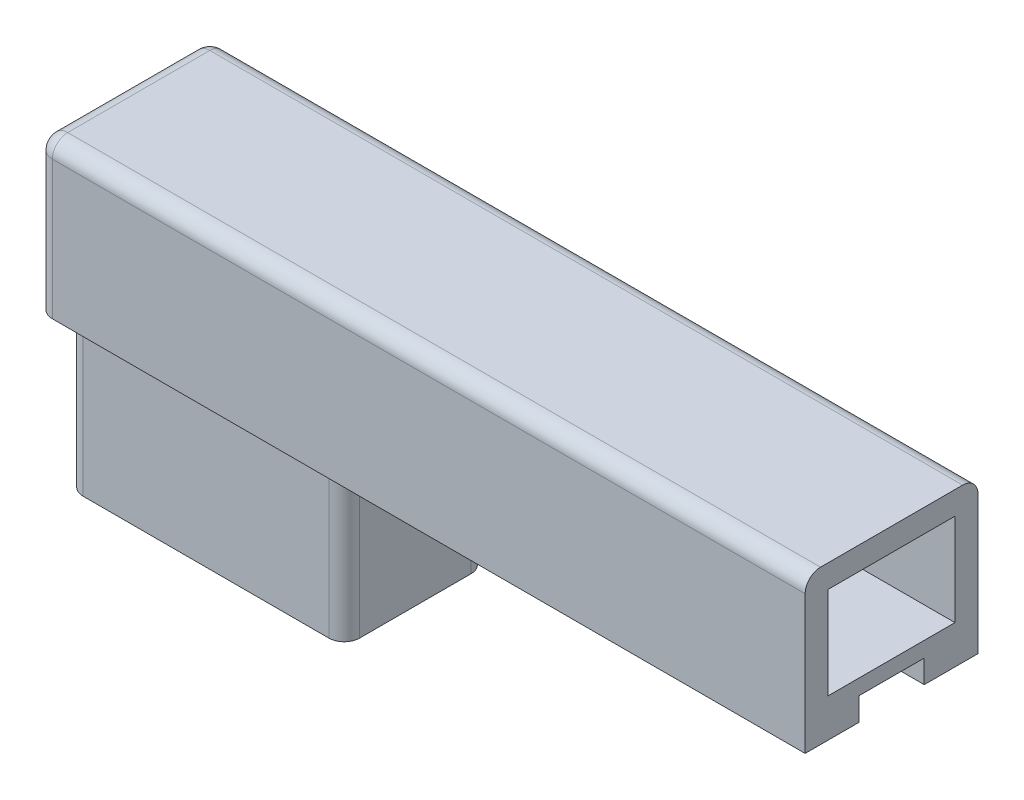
from build123d import *

# Parameters (mm, degrees)
SKIZZE1_W                       = 200
SKIZZE1_H                       = 45
AUFSATZ_LINEAR_AUSTRAGEN1_DEPTH = 40
SKIZZE2_W                       = 72
SKIZZE2_H                       = 37
AUFSATZ_LINEAR_AUSTRAGEN2_DEPTH = 40
WANDUNG2_T                      = -4
SKIZZE4_W                       = 4
SKIZZE4_H                       = 37
AUFSATZ_LINEAR_AUSTRAGEN3_DEPTH = 76
AUFSATZ_LINEAR_AUSTRAGEN4_REACH = 168.452
SKIZZE7_W                       = 126
SKIZZE7_H                       = 45
SKIZZE8_W                       = 33
SKIZZE8_H                       = 24
SCHNITT_LINEAR_AUSTRAGEN3_DEPTH = 45
SKIZZE10_W                      = 124
SKIZZE10_H                      = 17
SCHNITT_LINEAR_AUSTRAGEN4_DEPTH = 6
SKIZZE5_W                       = 17
SKIZZE5_H                       = 19
SCHNITT_LINEAR_AUSTRAGEN2_DEPTH = 45
VERRUNDUNG1_R                   = 4
VERRUNDUNG2_R                   = 4
VERRUNDUNG3_R                   = 4


with BuildPart() as part:
    # Skizze1 → Aufsatz-Linear austragen1 (new body)
    with BuildSketch(Plane(origin=(0, 0, 0), x_dir=(1, 0, 0), z_dir=(0, 1, 0))):
        with Locations((60, 0)):
            Rectangle(SKIZZE1_W, SKIZZE1_H)
    extrude(amount=AUFSATZ_LINEAR_AUSTRAGEN1_DEPTH)

    # Skizze2 → Aufsatz-Linear austragen2 (add)
    with BuildSketch(Plane.XZ):
        Rectangle(SKIZZE2_W, SKIZZE2_H)
    extrude(amount=AUFSATZ_LINEAR_AUSTRAGEN2_DEPTH)

    # Wandung2
    wandung2_openings = [part.faces().sort_by_distance(p)[0] for p in [
        (0, -40, 0),
    ]]
    offset(amount=WANDUNG2_T, openings=wandung2_openings, kind=Kind.INTERSECTION)

    # Skizze4 → Aufsatz-Linear austragen3 (add)
    with BuildSketch(Plane.XZ.offset(40)):
        with Locations((34, 0)):
            Rectangle(SKIZZE4_W, SKIZZE4_H)
    extrude(amount=-AUFSATZ_LINEAR_AUSTRAGEN3_DEPTH)

    # Skizze7 → Aufsatz-Linear austragen4 (add, up to next)
    with BuildSketch(Plane.XZ, mode=Mode.PRIVATE) as aufsatz_linear_austragen4_sk1:
        with Locations((97, 0)):
            Rectangle(SKIZZE7_W, SKIZZE7_H)
    aufsatz_linear_austragen4_tool1 = extrude(aufsatz_linear_austragen4_sk1.sketch, amount=-AUFSATZ_LINEAR_AUSTRAGEN4_REACH, mode=Mode.PRIVATE) - part.part
    add(aufsatz_linear_austragen4_tool1.solids().sort_by_distance((97, 0, 0))[0])

    # Skizze8 → Schnitt-Linear austragen3 (cut)
    with BuildSketch(Plane(origin=(160, 0, 0), x_dir=(0, 0, -1), z_dir=(1, 0, 0))):
        with Locations((0, 22)):
            Rectangle(SKIZZE8_W, SKIZZE8_H)
    extrude(amount=-SCHNITT_LINEAR_AUSTRAGEN3_DEPTH, mode=Mode.SUBTRACT)

    # Skizze10 → Schnitt-Linear austragen4 (cut)
    with BuildSketch(Plane.XZ):
        with Locations((98, 0)):
            Rectangle(SKIZZE10_W, SKIZZE10_H)
    extrude(amount=-SCHNITT_LINEAR_AUSTRAGEN4_DEPTH, mode=Mode.SUBTRACT)

    # Skizze5 → Schnitt-Linear austragen2 (cut)
    with BuildSketch(Plane(origin=(0, 0, 0), x_dir=(0, 0, -1), z_dir=(1, 0, 0))):
        with Locations((0, 10.5)):
            Rectangle(SKIZZE5_W, SKIZZE5_H)
    extrude(amount=SCHNITT_LINEAR_AUSTRAGEN2_DEPTH, mode=Mode.SUBTRACT)

    # Verrundung1
    verrundung1_edges = [part.edges().sort_by_distance(p)[0] for p in [
        (-40, 20, -22.5),
        (-40, 20, 22.5),
    ]]
    fillet(verrundung1_edges, radius=VERRUNDUNG1_R)

    # Verrundung2
    verrundung2_edges = [part.edges().sort_by_distance(p)[0] for p in [
        (62, 40, -22.5),
        (-40, 40, 0),
        (62, 40, 22.5),
        (-38.828427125, 40, 21.328427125),
        (-38.828427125, 40, -21.328427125),
    ]]
    fillet(verrundung2_edges, radius=VERRUNDUNG2_R)

    # Verrundung3
    verrundung3_edges = [part.edges().sort_by_distance(p)[0] for p in [
        (-36, -20, 18.5),
        (-36, -20, -18.5),
        (36, -20, -18.5),
        (36, -20, 18.5),
    ]]
    fillet(verrundung3_edges, radius=VERRUNDUNG3_R)


solid = part.part
